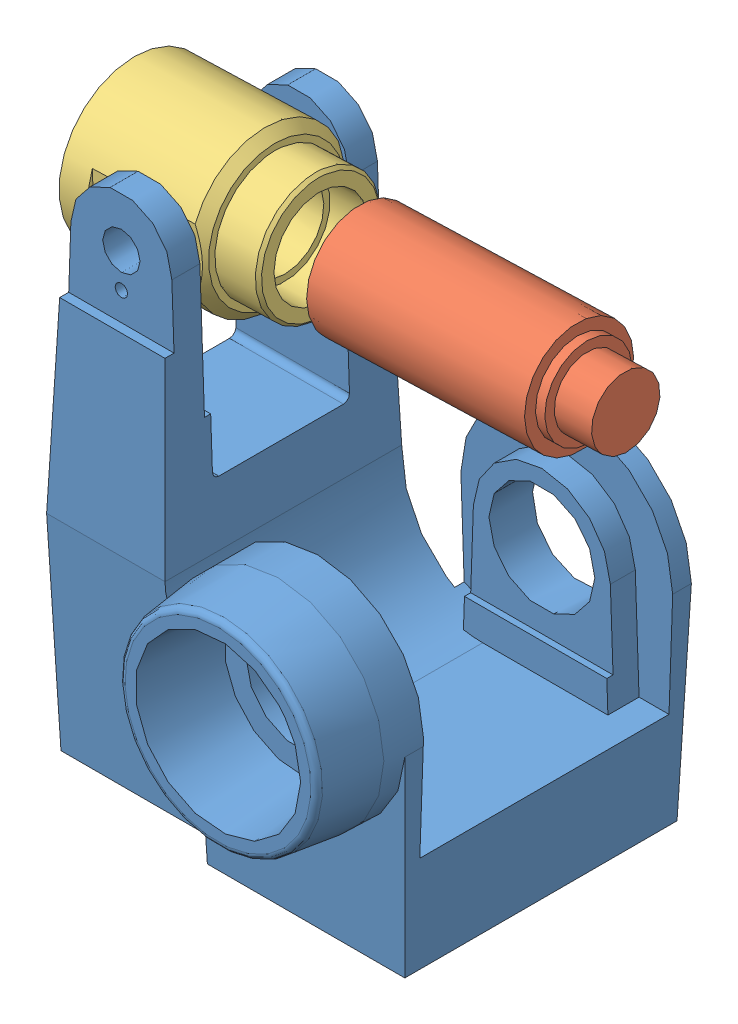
SolidWorks assembly Assemblage1.sldasm, configuration Défaut (file format 3400). Lengths in mm.
Overall size (158.72 181.92 118).
3 component instances, 3 part files, 3 mates.
Components (placement in the parent):
- Chaise-1: Chaise.SLDPRT [Défaut] at (16.1559 -6.0934 0) size (130.71 162.21 118)
- StatorMoteur-1: StatorMoteur.SLDPRT [Défaut] at (-8.875 75.3379 1) x (-0.999495 -0.031768 0) z (-0.009632 0.30303 0.952932) size (86 35 35)
- SupprotVisBille-1: SupprotVisBille.SLDPRT [Défaut] at (-33.8542 74.544 1) x (0.999495 0.031768 0) z (-0.018673 0.587489 0.809017) size (59 50 50)
Mates (geometry in assembly coordinates):
- Coaxiale2: concentric anti-aligned: cylinder of Chaise-1; cylinder of SupprotVisBille-1
- Coïncidente1: coincident anti-aligned: plane of Chaise-1 through (-36.1711 90.1129 24) normal (0 0 -1); plane of SupprotVisBille-1 through (-36.5415 64.6556 24) normal (0 0 1)
- Coaxiale3: concentric anti-aligned: cylinder of StatorMoteur-1; cylinder of SupprotVisBille-1
